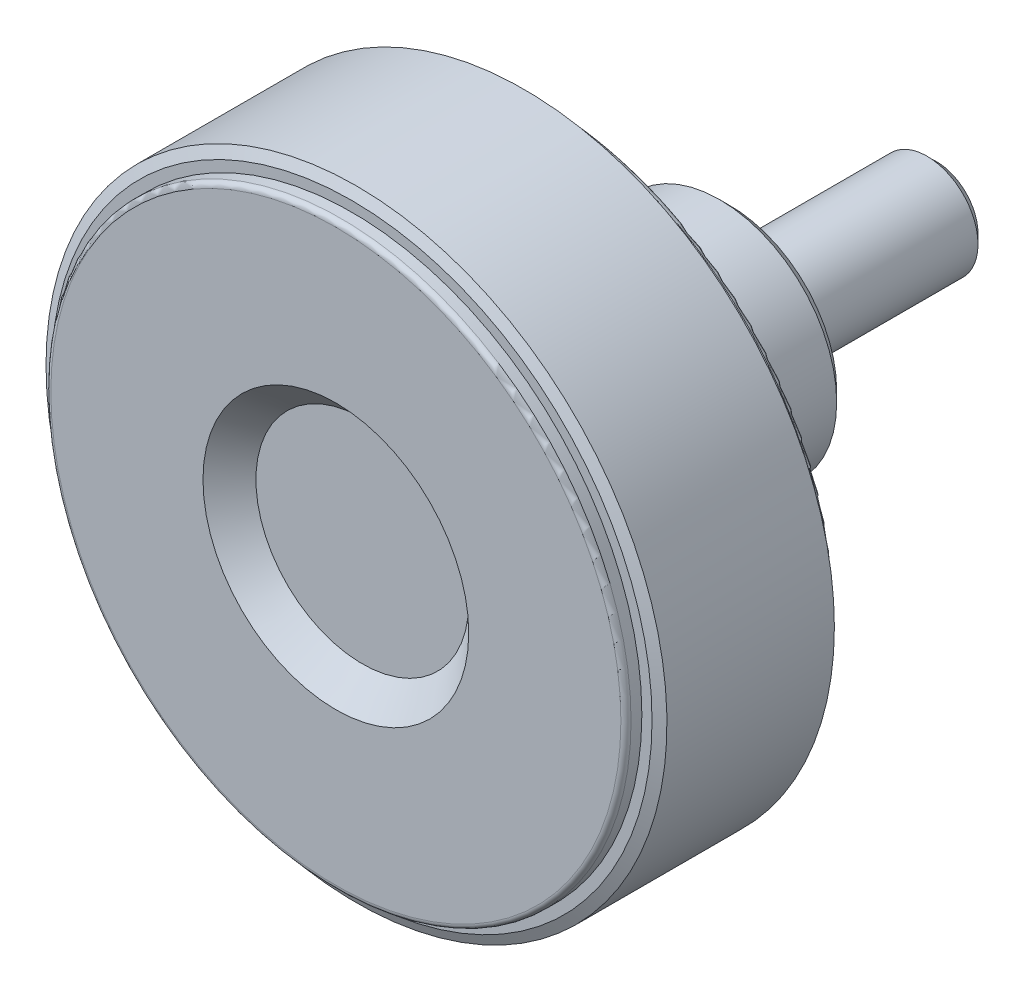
ISO-10303-21;
HEADER;
FILE_DESCRIPTION(('STEP AP214'),'2;1');
FILE_NAME('part.step','',(''),(''),'','','');
FILE_SCHEMA(('AUTOMOTIVE_DESIGN { 1 0 10303 214 1 1 1 1 }'));
ENDSEC;
DATA;
#1=APPLICATION_CONTEXT('core data for automotive mechanical design processes');
#2=APPLICATION_PROTOCOL_DEFINITION('international standard','automotive_design',2000,#1);
#3=PRODUCT_CONTEXT('',#1,'mechanical');
#4=PRODUCT('Part','Part','',(#3));
#5=PRODUCT_RELATED_PRODUCT_CATEGORY('part','',(#4));
#6=PRODUCT_DEFINITION_FORMATION('','',#4);
#7=PRODUCT_DEFINITION_CONTEXT('part definition',#1,'design');
#8=PRODUCT_DEFINITION('design','',#6,#7);
#9=PRODUCT_DEFINITION_SHAPE('','',#8);
#10=(LENGTH_UNIT() NAMED_UNIT(*) SI_UNIT(.MILLI.,.METRE.));
#11=(NAMED_UNIT(*) PLANE_ANGLE_UNIT() SI_UNIT($,.RADIAN.));
#12=(NAMED_UNIT(*) SI_UNIT($,.STERADIAN.) SOLID_ANGLE_UNIT());
#13=UNCERTAINTY_MEASURE_WITH_UNIT(LENGTH_MEASURE(1.E-05),#10,'distance_accuracy_value','');
#14=(GEOMETRIC_REPRESENTATION_CONTEXT(3) GLOBAL_UNCERTAINTY_ASSIGNED_CONTEXT((#13)) GLOBAL_UNIT_ASSIGNED_CONTEXT((#10,
#11,#12)) REPRESENTATION_CONTEXT('',''));
#15=CARTESIAN_POINT('',(0.,0.,0.));
#16=DIRECTION('',(0.,0.,1.));
#17=DIRECTION('',(1.,0.,0.));
#18=AXIS2_PLACEMENT_3D('',#15,#16,#17);
#19=CARTESIAN_POINT('',(0.,2.04,-20.));
#20=DIRECTION('',(0.,0.,-1.));
#21=DIRECTION('',(-1.,0.,0.));
#22=AXIS2_PLACEMENT_3D('',#19,#20,#21);
#23=PLANE('',#22);
#24=CARTESIAN_POINT('',(0.,0.,-19.9999999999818));
#25=DIRECTION('',(0.,0.,1.));
#26=DIRECTION('',(1.,0.,0.));
#27=AXIS2_PLACEMENT_3D('',#24,#25,#26);
#28=CIRCLE('',#27,4.07999999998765);
#29=CARTESIAN_POINT('',(4.07999999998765,0.,-19.9999999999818));
#30=VERTEX_POINT('',#29);
#31=EDGE_CURVE('E179',#30,#30,#28,.T.);
#32=ORIENTED_EDGE('',*,*,#31,.F.);
#33=EDGE_LOOP('',(#32));
#34=FACE_BOUND('',#33,.T.);
#35=ADVANCED_FACE('F14',(#34),#23,.T.);
#36=CARTESIAN_POINT('',(0.,0.,-19.0800000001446));
#37=DIRECTION('',(0.,0.,1.));
#38=DIRECTION('',(1.,0.,0.));
#39=AXIS2_PLACEMENT_3D('',#36,#37,#38);
#40=CONICAL_SURFACE('',#39,4.99999999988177,0.785398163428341);
#41=ORIENTED_EDGE('',*,*,#31,.T.);
#42=EDGE_LOOP('',(#41));
#43=FACE_BOUND('',#42,.T.);
#44=CARTESIAN_POINT('',(0.,0.,-19.08));
#45=DIRECTION('',(0.,0.,1.));
#46=DIRECTION('',(1.,0.,0.));
#47=AXIS2_PLACEMENT_3D('',#44,#45,#46);
#48=CIRCLE('',#47,5.);
#49=CARTESIAN_POINT('',(5.,0.,-19.08));
#50=VERTEX_POINT('',#49);
#51=EDGE_CURVE('E176',#50,#50,#48,.T.);
#52=ORIENTED_EDGE('',*,*,#51,.F.);
#53=EDGE_LOOP('',(#52));
#54=FACE_BOUND('',#53,.T.);
#55=ADVANCED_FACE('F536',(#43,#54),#40,.T.);
#56=CARTESIAN_POINT('',(0.,0.,-9.04));
#57=DIRECTION('',(0.,0.,1.));
#58=DIRECTION('',(1.,0.,0.));
#59=AXIS2_PLACEMENT_3D('',#56,#57,#58);
#60=CYLINDRICAL_SURFACE('',#59,5.);
#61=ORIENTED_EDGE('',*,*,#51,.T.);
#62=EDGE_LOOP('',(#61));
#63=FACE_BOUND('',#62,.T.);
#64=CARTESIAN_POINT('',(0.,0.,0.));
#65=DIRECTION('',(0.,0.,1.));
#66=DIRECTION('',(1.,0.,0.));
#67=AXIS2_PLACEMENT_3D('',#64,#65,#66);
#68=CIRCLE('',#67,5.);
#69=CARTESIAN_POINT('',(5.,0.,0.));
#70=VERTEX_POINT('',#69);
#71=EDGE_CURVE('E178',#70,#70,#68,.T.);
#72=ORIENTED_EDGE('',*,*,#71,.F.);
#73=EDGE_LOOP('',(#72));
#74=FACE_BOUND('',#73,.T.);
#75=ADVANCED_FACE('F526',(#63,#74),#60,.T.);
#76=CARTESIAN_POINT('',(0.,3.33333333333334,0.));
#77=DIRECTION('',(0.,0.,-1.));
#78=DIRECTION('',(-1.,0.,0.));
#79=AXIS2_PLACEMENT_3D('',#76,#77,#78);
#80=PLANE('',#79);
#81=CARTESIAN_POINT('',(0.,0.,0.));
#82=DIRECTION('',(0.,0.,1.));
#83=DIRECTION('',(1.,0.,0.));
#84=AXIS2_PLACEMENT_3D('',#81,#82,#83);
#85=CIRCLE('',#84,6.66666666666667);
#86=CARTESIAN_POINT('',(6.66666666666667,0.,0.));
#87=VERTEX_POINT('',#86);
#88=EDGE_CURVE('E211',#87,#87,#85,.T.);
#89=ORIENTED_EDGE('',*,*,#88,.F.);
#90=EDGE_LOOP('',(#89));
#91=FACE_BOUND('',#90,.T.);
#92=ORIENTED_EDGE('',*,*,#71,.T.);
#93=EDGE_LOOP('',(#92));
#94=FACE_BOUND('',#93,.T.);
#95=ADVANCED_FACE('F516',(#91,#94),#80,.T.);
#96=CARTESIAN_POINT('',(0.,0.,0.15));
#97=DIRECTION('',(0.,0.,1.));
#98=DIRECTION('',(1.,0.,0.));
#99=AXIS2_PLACEMENT_3D('',#96,#97,#98);
#100=CYLINDRICAL_SURFACE('',#99,6.66666666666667);
#101=ORIENTED_EDGE('',*,*,#88,.T.);
#102=EDGE_LOOP('',(#101));
#103=FACE_BOUND('',#102,.T.);
#104=CARTESIAN_POINT('',(0.,0.,0.3));
#105=DIRECTION('',(0.,0.,1.));
#106=DIRECTION('',(1.,0.,0.));
#107=AXIS2_PLACEMENT_3D('',#104,#105,#106);
#108=CIRCLE('',#107,6.66666666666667);
#109=CARTESIAN_POINT('',(6.66666666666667,0.,0.3));
#110=VERTEX_POINT('',#109);
#111=EDGE_CURVE('E208',#110,#110,#108,.T.);
#112=ORIENTED_EDGE('',*,*,#111,.F.);
#113=EDGE_LOOP('',(#112));
#114=FACE_BOUND('',#113,.T.);
#115=ADVANCED_FACE('F506',(#103,#114),#100,.T.);
#116=CARTESIAN_POINT('',(0.,8.58333333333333,0.3));
#117=DIRECTION('',(0.,0.,-1.));
#118=DIRECTION('',(-1.,0.,0.));
#119=AXIS2_PLACEMENT_3D('',#116,#117,#118);
#120=PLANE('',#119);
#121=CARTESIAN_POINT('',(0.,0.,0.3));
#122=DIRECTION('',(0.,0.,1.));
#123=DIRECTION('',(1.,0.,0.));
#124=AXIS2_PLACEMENT_3D('',#121,#122,#123);
#125=CIRCLE('',#124,10.5);
#126=CARTESIAN_POINT('',(10.5,0.,0.3));
#127=VERTEX_POINT('',#126);
#128=EDGE_CURVE('E175',#127,#127,#125,.T.);
#129=ORIENTED_EDGE('',*,*,#128,.F.);
#130=EDGE_LOOP('',(#129));
#131=FACE_BOUND('',#130,.T.);
#132=ORIENTED_EDGE('',*,*,#111,.T.);
#133=EDGE_LOOP('',(#132));
#134=FACE_BOUND('',#133,.T.);
#135=ADVANCED_FACE('F496',(#131,#134),#120,.T.);
#136=CARTESIAN_POINT('',(0.,0.,1.3));
#137=DIRECTION('',(0.,0.,1.));
#138=DIRECTION('',(1.,0.,0.));
#139=AXIS2_PLACEMENT_3D('',#136,#137,#138);
#140=CONICAL_SURFACE('',#139,11.5,0.785398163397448);
#141=ORIENTED_EDGE('',*,*,#128,.T.);
#142=EDGE_LOOP('',(#141));
#143=FACE_BOUND('',#142,.T.);
#144=CARTESIAN_POINT('',(0.,0.,1.3));
#145=DIRECTION('',(0.,0.,1.));
#146=DIRECTION('',(1.,0.,0.));
#147=AXIS2_PLACEMENT_3D('',#144,#145,#146);
#148=CIRCLE('',#147,11.5);
#149=CARTESIAN_POINT('',(11.5,0.,1.3));
#150=VERTEX_POINT('',#149);
#151=EDGE_CURVE('E172',#150,#150,#148,.T.);
#152=ORIENTED_EDGE('',*,*,#151,.F.);
#153=EDGE_LOOP('',(#152));
#154=FACE_BOUND('',#153,.T.);
#155=ADVANCED_FACE('F487',(#143,#154),#140,.T.);
#156=CARTESIAN_POINT('',(0.,0.,16.4));
#157=DIRECTION('',(0.,0.,1.));
#158=DIRECTION('',(1.,0.,0.));
#159=AXIS2_PLACEMENT_3D('',#156,#157,#158);
#160=CYLINDRICAL_SURFACE('',#159,11.5);
#161=ORIENTED_EDGE('',*,*,#151,.T.);
#162=EDGE_LOOP('',(#161));
#163=FACE_BOUND('',#162,.T.);
#164=CARTESIAN_POINT('',(0.,0.,31.5));
#165=DIRECTION('',(0.,0.,-1.));
#166=DIRECTION('',(-1.,0.,0.));
#167=AXIS2_PLACEMENT_3D('',#164,#165,#166);
#168=CIRCLE('',#167,11.5);
#169=CARTESIAN_POINT('',(-11.5,0.,31.5));
#170=VERTEX_POINT('',#169);
#171=EDGE_CURVE('E75',#170,#170,#168,.T.);
#172=ORIENTED_EDGE('',*,*,#171,.T.);
#173=EDGE_LOOP('',(#172));
#174=FACE_BOUND('',#173,.T.);
#175=ADVANCED_FACE('F482',(#163,#174),#160,.T.);
#176=CARTESIAN_POINT('',(0.,0.,31.5));
#177=DIRECTION('',(0.,0.,-1.));
#178=DIRECTION('',(-1.,0.,0.));
#179=AXIS2_PLACEMENT_3D('',#176,#177,#178);
#180=TOROIDAL_SURFACE('',#179,12.5,1.);
#181=CARTESIAN_POINT('',(0.,0.,32.5));
#182=DIRECTION('',(0.,0.,-1.));
#183=DIRECTION('',(1.,0.,0.));
#184=AXIS2_PLACEMENT_3D('',#181,#182,#183);
#185=CIRCLE('',#184,12.5);
#186=CARTESIAN_POINT('',(-12.5,0.,32.5));
#187=VERTEX_POINT('',#186);
#188=CARTESIAN_POINT('',(12.5,0.,32.5));
#189=VERTEX_POINT('',#188);
#190=EDGE_CURVE('E68',#187,#189,#185,.F.);
#191=ORIENTED_EDGE('',*,*,#190,.F.);
#192=CARTESIAN_POINT('',(0.,0.,32.5));
#193=DIRECTION('',(0.,0.,-1.));
#194=DIRECTION('',(-1.,0.,0.));
#195=AXIS2_PLACEMENT_3D('',#192,#193,#194);
#196=CIRCLE('',#195,12.5);
#197=CARTESIAN_POINT('',(0.,12.5,32.5));
#198=VERTEX_POINT('',#197);
#199=EDGE_CURVE('E71',#198,#187,#196,.F.);
#200=ORIENTED_EDGE('',*,*,#199,.F.);
#201=CARTESIAN_POINT('',(0.,0.,32.5));
#202=DIRECTION('',(0.,0.,-1.));
#203=DIRECTION('',(0.,1.,0.));
#204=AXIS2_PLACEMENT_3D('',#201,#202,#203);
#205=CIRCLE('',#204,12.5);
#206=EDGE_CURVE('E63',#189,#198,#205,.F.);
#207=ORIENTED_EDGE('',*,*,#206,.F.);
#208=EDGE_LOOP('',(#191,#200,#207));
#209=FACE_BOUND('',#208,.T.);
#210=ORIENTED_EDGE('',*,*,#171,.F.);
#211=EDGE_LOOP('',(#210));
#212=FACE_BOUND('',#211,.T.);
#213=ADVANCED_FACE('F66',(#209,#212),#180,.F.);
#214=CARTESIAN_POINT('',(0.,17.4807692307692,32.5));
#215=DIRECTION('',(0.,0.,-1.));
#216=DIRECTION('',(-1.,0.,0.));
#217=AXIS2_PLACEMENT_3D('',#214,#215,#216);
#218=PLANE('',#217);
#219=CARTESIAN_POINT('',(0.,0.,32.5));
#220=DIRECTION('',(0.,0.,1.));
#221=DIRECTION('',(-1.,0.,0.));
#222=AXIS2_PLACEMENT_3D('',#219,#220,#221);
#223=CIRCLE('',#222,22.4615384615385);
#224=CARTESIAN_POINT('',(22.4615384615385,0.,32.5));
#225=VERTEX_POINT('',#224);
#226=CARTESIAN_POINT('',(-22.4615384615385,0.,32.5));
#227=VERTEX_POINT('',#226);
#228=EDGE_CURVE('E81',#225,#227,#223,.F.);
#229=ORIENTED_EDGE('',*,*,#228,.T.);
#230=CARTESIAN_POINT('',(0.,0.,32.5));
#231=DIRECTION('',(0.,0.,1.));
#232=DIRECTION('',(0.,1.,0.));
#233=AXIS2_PLACEMENT_3D('',#230,#231,#232);
#234=CIRCLE('',#233,22.4615384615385);
#235=CARTESIAN_POINT('',(0.,22.4615384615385,32.5));
#236=VERTEX_POINT('',#235);
#237=EDGE_CURVE('E130',#227,#236,#234,.F.);
#238=ORIENTED_EDGE('',*,*,#237,.T.);
#239=CARTESIAN_POINT('',(0.,0.,32.5));
#240=DIRECTION('',(0.,0.,1.));
#241=DIRECTION('',(1.,0.,0.));
#242=AXIS2_PLACEMENT_3D('',#239,#240,#241);
#243=CIRCLE('',#242,22.4615384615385);
#244=EDGE_CURVE('E143',#236,#225,#243,.F.);
#245=ORIENTED_EDGE('',*,*,#244,.T.);
#246=EDGE_LOOP('',(#229,#238,#245));
#247=FACE_BOUND('',#246,.T.);
#248=ORIENTED_EDGE('',*,*,#199,.T.);
#249=ORIENTED_EDGE('',*,*,#190,.T.);
#250=ORIENTED_EDGE('',*,*,#206,.T.);
#251=EDGE_LOOP('',(#248,#249,#250));
#252=FACE_BOUND('',#251,.T.);
#253=ADVANCED_FACE('F79',(#247,#252),#218,.T.);
#254=CARTESIAN_POINT('',(0.,0.,31.5));
#255=DIRECTION('',(0.,0.,-1.));
#256=DIRECTION('',(-1.,0.,0.));
#257=AXIS2_PLACEMENT_3D('',#254,#255,#256);
#258=TOROIDAL_SURFACE('',#257,22.4615384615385,1.);
#259=ORIENTED_EDGE('',*,*,#237,.F.);
#260=ORIENTED_EDGE('',*,*,#228,.F.);
#261=ORIENTED_EDGE('',*,*,#244,.F.);
#262=EDGE_LOOP('',(#259,#260,#261));
#263=FACE_BOUND('',#262,.T.);
#264=CARTESIAN_POINT('',(0.,0.,31.5));
#265=DIRECTION('',(0.,0.,1.));
#266=DIRECTION('',(1.,0.,0.));
#267=AXIS2_PLACEMENT_3D('',#264,#265,#266);
#268=CIRCLE('',#267,23.4615384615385);
#269=CARTESIAN_POINT('',(23.4615384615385,0.,31.5));
#270=VERTEX_POINT('',#269);
#271=EDGE_CURVE('E205',#270,#270,#268,.F.);
#272=ORIENTED_EDGE('',*,*,#271,.T.);
#273=EDGE_LOOP('',(#272));
#274=FACE_BOUND('',#273,.T.);
#275=ADVANCED_FACE('F100',(#263,#274),#258,.F.);
#276=CARTESIAN_POINT('',(0.,0.,25.));
#277=DIRECTION('',(0.,0.,1.));
#278=DIRECTION('',(1.,0.,0.));
#279=AXIS2_PLACEMENT_3D('',#276,#277,#278);
#280=CYLINDRICAL_SURFACE('',#279,23.4615384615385);
#281=ORIENTED_EDGE('',*,*,#271,.F.);
#282=EDGE_LOOP('',(#281));
#283=FACE_BOUND('',#282,.T.);
#284=CARTESIAN_POINT('',(0.,0.,18.5));
#285=DIRECTION('',(0.,0.,1.));
#286=DIRECTION('',(1.,0.,0.));
#287=AXIS2_PLACEMENT_3D('',#284,#285,#286);
#288=CIRCLE('',#287,23.4615384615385);
#289=CARTESIAN_POINT('',(23.4615384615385,0.,18.5));
#290=VERTEX_POINT('',#289);
#291=EDGE_CURVE('E201',#290,#290,#288,.T.);
#292=ORIENTED_EDGE('',*,*,#291,.F.);
#293=EDGE_LOOP('',(#292));
#294=FACE_BOUND('',#293,.T.);
#295=ADVANCED_FACE('F329',(#283,#294),#280,.F.);
#296=CARTESIAN_POINT('',(0.,25.7307692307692,18.5));
#297=DIRECTION('',(0.,0.,-1.));
#298=DIRECTION('',(-1.,0.,0.));
#299=AXIS2_PLACEMENT_3D('',#296,#297,#298);
#300=PLANE('',#299);
#301=CARTESIAN_POINT('',(0.,0.,18.5));
#302=DIRECTION('',(0.,0.,1.));
#303=DIRECTION('',(-1.,0.,0.));
#304=AXIS2_PLACEMENT_3D('',#301,#302,#303);
#305=CIRCLE('',#304,28.);
#306=CARTESIAN_POINT('',(-28.,0.,18.5));
#307=VERTEX_POINT('',#306);
#308=CARTESIAN_POINT('',(28.,0.,18.5));
#309=VERTEX_POINT('',#308);
#310=EDGE_CURVE('E264',#307,#309,#305,.T.);
#311=ORIENTED_EDGE('',*,*,#310,.F.);
#312=CARTESIAN_POINT('',(0.,0.,18.5));
#313=DIRECTION('',(0.,0.,1.));
#314=DIRECTION('',(0.,1.,0.));
#315=AXIS2_PLACEMENT_3D('',#312,#313,#314);
#316=CIRCLE('',#315,28.);
#317=CARTESIAN_POINT('',(0.,28.,18.5));
#318=VERTEX_POINT('',#317);
#319=EDGE_CURVE('E299',#318,#307,#316,.T.);
#320=ORIENTED_EDGE('',*,*,#319,.F.);
#321=CARTESIAN_POINT('',(0.,0.,18.5));
#322=DIRECTION('',(0.,0.,1.));
#323=DIRECTION('',(1.,0.,0.));
#324=AXIS2_PLACEMENT_3D('',#321,#322,#323);
#325=CIRCLE('',#324,28.);
#326=EDGE_CURVE('E204',#309,#318,#325,.T.);
#327=ORIENTED_EDGE('',*,*,#326,.F.);
#328=EDGE_LOOP('',(#311,#320,#327));
#329=FACE_BOUND('',#328,.T.);
#330=ORIENTED_EDGE('',*,*,#291,.T.);
#331=EDGE_LOOP('',(#330));
#332=FACE_BOUND('',#331,.T.);
#333=ADVANCED_FACE('F275',(#329,#332),#300,.T.);
#334=CARTESIAN_POINT('',(0.,0.,19.));
#335=DIRECTION('',(0.,0.,-1.));
#336=DIRECTION('',(-1.,0.,0.));
#337=AXIS2_PLACEMENT_3D('',#334,#335,#336);
#338=TOROIDAL_SURFACE('',#337,28.,0.5);
#339=ORIENTED_EDGE('',*,*,#319,.T.);
#340=ORIENTED_EDGE('',*,*,#310,.T.);
#341=ORIENTED_EDGE('',*,*,#326,.T.);
#342=EDGE_LOOP('',(#339,#340,#341));
#343=FACE_BOUND('',#342,.T.);
#344=CARTESIAN_POINT('',(0.,0.,19.));
#345=DIRECTION('',(0.,0.,1.));
#346=DIRECTION('',(1.,0.,0.));
#347=AXIS2_PLACEMENT_3D('',#344,#345,#346);
#348=CIRCLE('',#347,28.5);
#349=CARTESIAN_POINT('',(28.5,0.,19.));
#350=VERTEX_POINT('',#349);
#351=EDGE_CURVE('E200',#350,#350,#348,.T.);
#352=ORIENTED_EDGE('',*,*,#351,.F.);
#353=EDGE_LOOP('',(#352));
#354=FACE_BOUND('',#353,.T.);
#355=ADVANCED_FACE('F269',(#343,#354),#338,.T.);
#356=CARTESIAN_POINT('',(0.,0.,19.53));
#357=DIRECTION('',(0.,0.,1.));
#358=DIRECTION('',(1.,0.,0.));
#359=AXIS2_PLACEMENT_3D('',#356,#357,#358);
#360=CYLINDRICAL_SURFACE('',#359,28.5);
#361=ORIENTED_EDGE('',*,*,#351,.T.);
#362=EDGE_LOOP('',(#361));
#363=FACE_BOUND('',#362,.T.);
#364=CARTESIAN_POINT('',(0.,0.,20.06));
#365=DIRECTION('',(0.,0.,1.));
#366=DIRECTION('',(1.,0.,0.));
#367=AXIS2_PLACEMENT_3D('',#364,#365,#366);
#368=CIRCLE('',#367,28.5);
#369=CARTESIAN_POINT('',(28.5,0.,20.06));
#370=VERTEX_POINT('',#369);
#371=EDGE_CURVE('E197',#370,#370,#368,.T.);
#372=ORIENTED_EDGE('',*,*,#371,.F.);
#373=EDGE_LOOP('',(#372));
#374=FACE_BOUND('',#373,.T.);
#375=ADVANCED_FACE('F274',(#363,#374),#360,.T.);
#376=CARTESIAN_POINT('',(0.,29.,20.06));
#377=DIRECTION('',(0.,0.,-1.));
#378=DIRECTION('',(-1.,0.,0.));
#379=AXIS2_PLACEMENT_3D('',#376,#377,#378);
#380=PLANE('',#379);
#381=CARTESIAN_POINT('',(0.,0.,20.06));
#382=DIRECTION('',(0.,0.,1.));
#383=DIRECTION('',(1.,0.,0.));
#384=AXIS2_PLACEMENT_3D('',#381,#382,#383);
#385=CIRCLE('',#384,29.5);
#386=CARTESIAN_POINT('',(29.5,0.,20.06));
#387=VERTEX_POINT('',#386);
#388=EDGE_CURVE('E193',#387,#387,#385,.T.);
#389=ORIENTED_EDGE('',*,*,#388,.F.);
#390=EDGE_LOOP('',(#389));
#391=FACE_BOUND('',#390,.T.);
#392=ORIENTED_EDGE('',*,*,#371,.T.);
#393=EDGE_LOOP('',(#392));
#394=FACE_BOUND('',#393,.T.);
#395=ADVANCED_FACE('F342',(#391,#394),#380,.T.);
#396=CARTESIAN_POINT('',(0.,0.,20.526307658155));
#397=DIRECTION('',(0.,0.,1.));
#398=DIRECTION('',(1.,0.,0.));
#399=AXIS2_PLACEMENT_3D('',#396,#397,#398);
#400=CONICAL_SURFACE('',#399,30.5,1.13446401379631);
#401=CARTESIAN_POINT('',(-1.81188397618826E-13,-3.78364006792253E-12,20.526307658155));
#402=DIRECTION('',(0.,0.,-1.));
#403=DIRECTION('',(-1.,0.,0.));
#404=AXIS2_PLACEMENT_3D('',#401,#402,#403);
#405=CIRCLE('',#404,30.5000000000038);
#406=CARTESIAN_POINT('',(-30.500000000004,-3.78364006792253E-12,20.526307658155));
#407=VERTEX_POINT('',#406);
#408=EDGE_CURVE('E196',#407,#407,#405,.F.);
#409=ORIENTED_EDGE('',*,*,#408,.F.);
#410=EDGE_LOOP('',(#409));
#411=FACE_BOUND('',#410,.T.);
#412=ORIENTED_EDGE('',*,*,#388,.T.);
#413=EDGE_LOOP('',(#412));
#414=FACE_BOUND('',#413,.T.);
#415=ADVANCED_FACE('F340',(#411,#414),#400,.T.);
#416=CARTESIAN_POINT('',(0.,5.22727272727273,36.4));
#417=DIRECTION('',(0.,0.,1.));
#418=DIRECTION('',(1.,0.,0.));
#419=AXIS2_PLACEMENT_3D('',#416,#417,#418);
#420=PLANE('',#419);
#421=CARTESIAN_POINT('',(0.,0.,36.4));
#422=DIRECTION('',(0.,0.,1.));
#423=DIRECTION('',(1.,0.,0.));
#424=AXIS2_PLACEMENT_3D('',#421,#422,#423);
#425=CIRCLE('',#424,10.4545454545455);
#426=CARTESIAN_POINT('',(10.4545454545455,0.,36.4));
#427=VERTEX_POINT('',#426);
#428=EDGE_CURVE('E181',#427,#427,#425,.T.);
#429=ORIENTED_EDGE('',*,*,#428,.T.);
#430=EDGE_LOOP('',(#429));
#431=FACE_BOUND('',#430,.T.);
#432=ADVANCED_FACE('F242',(#431),#420,.T.);
#433=CARTESIAN_POINT('',(0.,0.,39.));
#434=DIRECTION('',(0.,0.,1.));
#435=DIRECTION('',(1.,0.,0.));
#436=AXIS2_PLACEMENT_3D('',#433,#434,#435);
#437=CONICAL_SURFACE('',#436,13.0545454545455,0.785398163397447);
#438=CARTESIAN_POINT('',(0.,0.,39.));
#439=DIRECTION('',(0.,0.,1.));
#440=DIRECTION('',(1.,0.,0.));
#441=AXIS2_PLACEMENT_3D('',#438,#439,#440);
#442=CIRCLE('',#441,13.0545454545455);
#443=CARTESIAN_POINT('',(13.0545454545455,0.,39.));
#444=VERTEX_POINT('',#443);
#445=EDGE_CURVE('E9',#444,#444,#442,.F.);
#446=ORIENTED_EDGE('',*,*,#445,.F.);
#447=EDGE_LOOP('',(#446));
#448=FACE_BOUND('',#447,.T.);
#449=ORIENTED_EDGE('',*,*,#428,.F.);
#450=EDGE_LOOP('',(#449));
#451=FACE_BOUND('',#450,.T.);
#452=ADVANCED_FACE('F240',(#448,#451),#437,.F.);
#453=CARTESIAN_POINT('',(0.,20.5272727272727,39.));
#454=DIRECTION('',(0.,0.,1.));
#455=DIRECTION('',(1.,0.,0.));
#456=AXIS2_PLACEMENT_3D('',#453,#454,#455);
#457=PLANE('',#456);
#458=ORIENTED_EDGE('',*,*,#445,.T.);
#459=EDGE_LOOP('',(#458));
#460=FACE_BOUND('',#459,.T.);
#461=CARTESIAN_POINT('',(0.,0.,39.));
#462=DIRECTION('',(0.,0.,-1.));
#463=DIRECTION('',(-1.,0.,0.));
#464=AXIS2_PLACEMENT_3D('',#461,#462,#463);
#465=CIRCLE('',#464,28.);
#466=CARTESIAN_POINT('',(0.,28.,39.));
#467=VERTEX_POINT('',#466);
#468=CARTESIAN_POINT('',(-28.,0.,39.));
#469=VERTEX_POINT('',#468);
#470=EDGE_CURVE('E219',#467,#469,#465,.F.);
#471=ORIENTED_EDGE('',*,*,#470,.T.);
#472=CARTESIAN_POINT('',(0.,0.,39.));
#473=DIRECTION('',(0.,0.,-1.));
#474=DIRECTION('',(1.,0.,0.));
#475=AXIS2_PLACEMENT_3D('',#472,#473,#474);
#476=CIRCLE('',#475,28.);
#477=CARTESIAN_POINT('',(28.,0.,39.));
#478=VERTEX_POINT('',#477);
#479=EDGE_CURVE('E23',#469,#478,#476,.F.);
#480=ORIENTED_EDGE('',*,*,#479,.T.);
#481=CARTESIAN_POINT('',(0.,0.,39.));
#482=DIRECTION('',(0.,0.,-1.));
#483=DIRECTION('',(0.,1.,0.));
#484=AXIS2_PLACEMENT_3D('',#481,#482,#483);
#485=CIRCLE('',#484,28.);
#486=EDGE_CURVE('E184',#478,#467,#485,.F.);
#487=ORIENTED_EDGE('',*,*,#486,.T.);
#488=EDGE_LOOP('',(#471,#480,#487));
#489=FACE_BOUND('',#488,.T.);
#490=ADVANCED_FACE('F238',(#460,#489),#457,.T.);
#491=CARTESIAN_POINT('',(0.,0.,38.5));
#492=DIRECTION('',(0.,0.,-1.));
#493=DIRECTION('',(-1.,0.,0.));
#494=AXIS2_PLACEMENT_3D('',#491,#492,#493);
#495=TOROIDAL_SURFACE('',#494,28.,0.5);
#496=CARTESIAN_POINT('',(0.,0.,38.5));
#497=DIRECTION('',(0.,0.,-1.));
#498=DIRECTION('',(-1.,0.,0.));
#499=AXIS2_PLACEMENT_3D('',#496,#497,#498);
#500=CIRCLE('',#499,28.5);
#501=CARTESIAN_POINT('',(-28.5,0.,38.5));
#502=VERTEX_POINT('',#501);
#503=EDGE_CURVE('E185',#502,#502,#500,.F.);
#504=ORIENTED_EDGE('',*,*,#503,.T.);
#505=EDGE_LOOP('',(#504));
#506=FACE_BOUND('',#505,.T.);
#507=ORIENTED_EDGE('',*,*,#479,.F.);
#508=ORIENTED_EDGE('',*,*,#470,.F.);
#509=ORIENTED_EDGE('',*,*,#486,.F.);
#510=EDGE_LOOP('',(#507,#508,#509));
#511=FACE_BOUND('',#510,.T.);
#512=ADVANCED_FACE('F226',(#506,#511),#495,.T.);
#513=CARTESIAN_POINT('',(0.,0.,37.97));
#514=DIRECTION('',(0.,0.,1.));
#515=DIRECTION('',(1.,0.,0.));
#516=AXIS2_PLACEMENT_3D('',#513,#514,#515);
#517=CYLINDRICAL_SURFACE('',#516,28.5);
#518=ORIENTED_EDGE('',*,*,#503,.F.);
#519=EDGE_LOOP('',(#518));
#520=FACE_BOUND('',#519,.T.);
#521=CARTESIAN_POINT('',(0.,0.,37.44));
#522=DIRECTION('',(0.,0.,1.));
#523=DIRECTION('',(1.,0.,0.));
#524=AXIS2_PLACEMENT_3D('',#521,#522,#523);
#525=CIRCLE('',#524,28.5);
#526=CARTESIAN_POINT('',(28.5,0.,37.44));
#527=VERTEX_POINT('',#526);
#528=EDGE_CURVE('E186',#527,#527,#525,.T.);
#529=ORIENTED_EDGE('',*,*,#528,.T.);
#530=EDGE_LOOP('',(#529));
#531=FACE_BOUND('',#530,.T.);
#532=ADVANCED_FACE('F237',(#520,#531),#517,.T.);
#533=CARTESIAN_POINT('',(0.,0.,36.973692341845));
#534=DIRECTION('',(0.,0.,-1.));
#535=DIRECTION('',(-1.,0.,0.));
#536=AXIS2_PLACEMENT_3D('',#533,#534,#535);
#537=CONICAL_SURFACE('',#536,30.5,1.13446401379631);
#538=CARTESIAN_POINT('',(0.,0.,37.44));
#539=DIRECTION('',(0.,0.,-1.));
#540=DIRECTION('',(-1.,0.,0.));
#541=AXIS2_PLACEMENT_3D('',#538,#539,#540);
#542=CIRCLE('',#541,29.5);
#543=CARTESIAN_POINT('',(-29.5,0.,37.44));
#544=VERTEX_POINT('',#543);
#545=EDGE_CURVE('E189',#544,#544,#542,.F.);
#546=ORIENTED_EDGE('',*,*,#545,.F.);
#547=EDGE_LOOP('',(#546));
#548=FACE_BOUND('',#547,.T.);
#549=CARTESIAN_POINT('',(0.,0.,36.973692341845));
#550=DIRECTION('',(0.,0.,-1.));
#551=DIRECTION('',(0.,1.,0.));
#552=AXIS2_PLACEMENT_3D('',#549,#550,#551);
#553=CIRCLE('',#552,30.5);
#554=CARTESIAN_POINT('',(0.,30.5,36.973692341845));
#555=VERTEX_POINT('',#554);
#556=EDGE_CURVE('E192',#555,#555,#553,.F.);
#557=ORIENTED_EDGE('',*,*,#556,.T.);
#558=EDGE_LOOP('',(#557));
#559=FACE_BOUND('',#558,.T.);
#560=ADVANCED_FACE('F360',(#548,#559),#537,.T.);
#561=CARTESIAN_POINT('',(0.,29.,37.44));
#562=DIRECTION('',(0.,0.,1.));
#563=DIRECTION('',(1.,0.,0.));
#564=AXIS2_PLACEMENT_3D('',#561,#562,#563);
#565=PLANE('',#564);
#566=ORIENTED_EDGE('',*,*,#528,.F.);
#567=EDGE_LOOP('',(#566));
#568=FACE_BOUND('',#567,.T.);
#569=ORIENTED_EDGE('',*,*,#545,.T.);
#570=EDGE_LOOP('',(#569));
#571=FACE_BOUND('',#570,.T.);
#572=ADVANCED_FACE('F358',(#568,#571),#565,.T.);
#573=CARTESIAN_POINT('',(-1.81188397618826E-13,-3.78364006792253E-12,0.));
#574=DIRECTION('',(0.,0.,-1.));
#575=DIRECTION('',(-1.,0.,0.));
#576=AXIS2_PLACEMENT_3D('',#573,#574,#575);
#577=CYLINDRICAL_SURFACE('',#576,30.5000000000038);
#578=ORIENTED_EDGE('',*,*,#408,.T.);
#579=EDGE_LOOP('',(#578));
#580=FACE_BOUND('',#579,.T.);
#581=ORIENTED_EDGE('',*,*,#556,.F.);
#582=EDGE_LOOP('',(#581));
#583=FACE_BOUND('',#582,.T.);
#584=ADVANCED_FACE('F355',(#580,#583),#577,.T.);
#585=CLOSED_SHELL('',(#35,#55,#75,#95,#115,#135,#155,#175,#213,#253,#275,#295,#333,#355,#375,
#395,#415,#432,#452,#490,#512,#532,#560,#572,#584));
#586=MANIFOLD_SOLID_BREP('B1',#585);
#587=ADVANCED_BREP_SHAPE_REPRESENTATION('',(#18,#586),#14);
#588=SHAPE_DEFINITION_REPRESENTATION(#9,#587);
ENDSEC;
END-ISO-10303-21;
